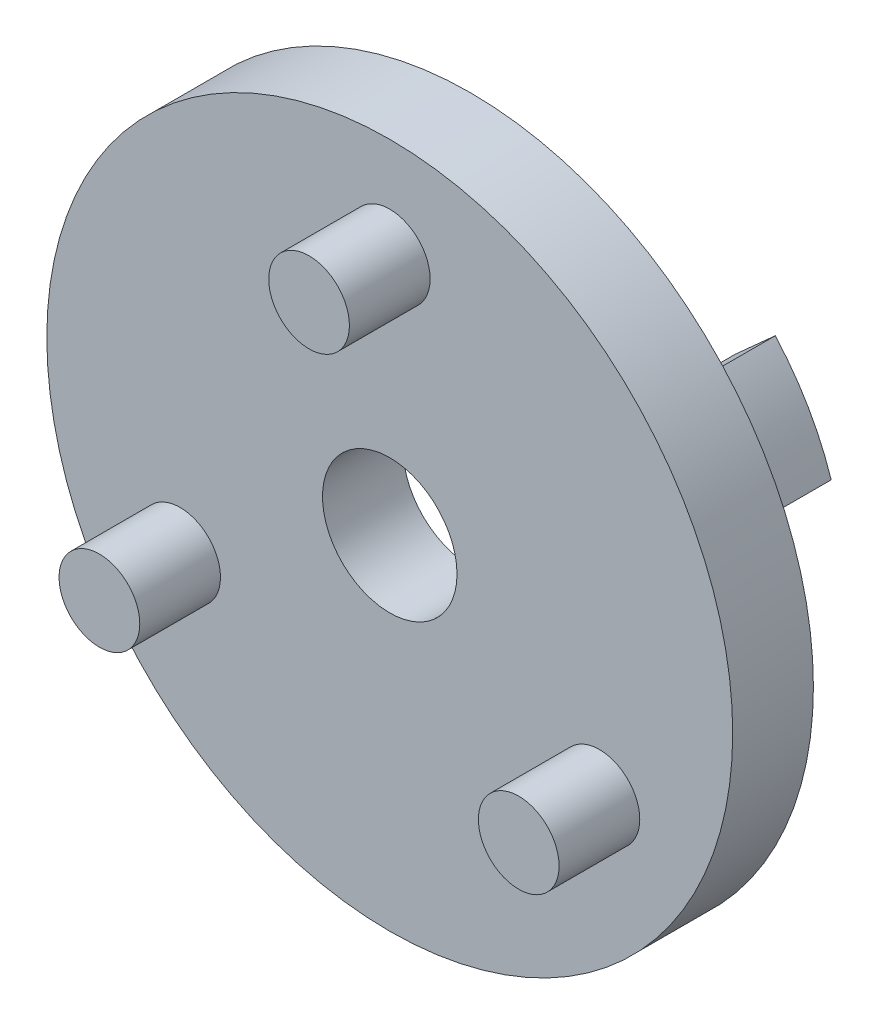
ISO-10303-21;
HEADER;
FILE_DESCRIPTION(('STEP AP214'),'2;1');
FILE_NAME('part.step','',(''),(''),'','','');
FILE_SCHEMA(('AUTOMOTIVE_DESIGN { 1 0 10303 214 1 1 1 1 }'));
ENDSEC;
DATA;
#1=APPLICATION_CONTEXT('core data for automotive mechanical design processes');
#2=APPLICATION_PROTOCOL_DEFINITION('international standard','automotive_design',2000,#1);
#3=PRODUCT_CONTEXT('',#1,'mechanical');
#4=PRODUCT('Part','Part','',(#3));
#5=PRODUCT_RELATED_PRODUCT_CATEGORY('part','',(#4));
#6=PRODUCT_DEFINITION_FORMATION('','',#4);
#7=PRODUCT_DEFINITION_CONTEXT('part definition',#1,'design');
#8=PRODUCT_DEFINITION('design','',#6,#7);
#9=PRODUCT_DEFINITION_SHAPE('','',#8);
#10=(LENGTH_UNIT() NAMED_UNIT(*) SI_UNIT(.MILLI.,.METRE.));
#11=(NAMED_UNIT(*) PLANE_ANGLE_UNIT() SI_UNIT($,.RADIAN.));
#12=(NAMED_UNIT(*) SI_UNIT($,.STERADIAN.) SOLID_ANGLE_UNIT());
#13=UNCERTAINTY_MEASURE_WITH_UNIT(LENGTH_MEASURE(1.E-05),#10,'distance_accuracy_value','');
#14=(GEOMETRIC_REPRESENTATION_CONTEXT(3) GLOBAL_UNCERTAINTY_ASSIGNED_CONTEXT((#13)) GLOBAL_UNIT_ASSIGNED_CONTEXT((#10,
#11,#12)) REPRESENTATION_CONTEXT('',''));
#15=CARTESIAN_POINT('',(0.,0.,0.));
#16=DIRECTION('',(0.,0.,1.));
#17=DIRECTION('',(1.,0.,0.));
#18=AXIS2_PLACEMENT_3D('',#15,#16,#17);
#19=CARTESIAN_POINT('',(0.,0.,0.));
#20=DIRECTION('',(0.,0.,1.));
#21=DIRECTION('',(1.,0.,0.));
#22=AXIS2_PLACEMENT_3D('',#19,#20,#21);
#23=PLANE('',#22);
#24=CARTESIAN_POINT('',(0.0188050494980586,0.00503879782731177,0.));
#25=DIRECTION('',(0.,0.,1.));
#26=DIRECTION('',(-1.,0.,0.));
#27=AXIS2_PLACEMENT_3D('',#24,#25,#26);
#28=CIRCLE('',#27,7.99999999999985);
#29=CARTESIAN_POINT('',(-5.92635355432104,5.35808364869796,0.));
#30=VERTEX_POINT('',#29);
#31=CARTESIAN_POINT('',(-7.58964708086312,2.47717475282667,0.));
#32=VERTEX_POINT('',#31);
#33=EDGE_CURVE('E147',#30,#32,#28,.T.);
#34=ORIENTED_EDGE('',*,*,#33,.F.);
#35=DIRECTION('',(0.743144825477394,-0.669130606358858,0.));
#36=VECTOR('',#35,1.);
#37=CARTESIAN_POINT('',(-5.92635355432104,5.35808364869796,0.));
#38=LINE('',#37,#36);
#39=CARTESIAN_POINT('',(-7.41264320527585,6.6963448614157,0.));
#40=VERTEX_POINT('',#39);
#41=EDGE_CURVE('E156',#40,#30,#38,.T.);
#42=ORIENTED_EDGE('',*,*,#41,.F.);
#43=CARTESIAN_POINT('',(0.0188050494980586,0.00503879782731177,0.));
#44=DIRECTION('',(0.,0.,-1.));
#45=DIRECTION('',(-1.,0.,0.));
#46=AXIS2_PLACEMENT_3D('',#43,#44,#45);
#47=CIRCLE('',#46,9.99999999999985);
#48=CARTESIAN_POINT('',(-9.49176011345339,3.09520874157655,0.));
#49=VERTEX_POINT('',#48);
#50=EDGE_CURVE('E153',#49,#40,#47,.T.);
#51=ORIENTED_EDGE('',*,*,#50,.F.);
#52=DIRECTION('',(-0.951056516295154,0.309016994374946,0.));
#53=VECTOR('',#52,1.);
#54=CARTESIAN_POINT('',(-7.58964708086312,2.47717475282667,0.));
#55=LINE('',#54,#53);
#56=EDGE_CURVE('E150',#32,#49,#55,.T.);
#57=ORIENTED_EDGE('',*,*,#56,.F.);
#58=EDGE_LOOP('',(#34,#42,#51,#57));
#59=FACE_BOUND('',#58,.T.);
#60=CARTESIAN_POINT('',(0.,0.,0.));
#61=DIRECTION('',(0.,0.,1.));
#62=DIRECTION('',(1.,0.,0.));
#63=AXIS2_PLACEMENT_3D('',#60,#61,#62);
#64=CIRCLE('',#63,2.5);
#65=CARTESIAN_POINT('',(2.5,0.,0.));
#66=VERTEX_POINT('',#65);
#67=EDGE_CURVE('E231',#66,#66,#64,.T.);
#68=ORIENTED_EDGE('',*,*,#67,.T.);
#69=EDGE_LOOP('',(#68));
#70=FACE_BOUND('',#69,.T.);
#71=CARTESIAN_POINT('',(0.,0.,0.));
#72=DIRECTION('',(0.,0.,1.));
#73=DIRECTION('',(1.,0.,0.));
#74=AXIS2_PLACEMENT_3D('',#71,#72,#73);
#75=CIRCLE('',#74,12.75);
#76=CARTESIAN_POINT('',(12.75,0.,0.));
#77=VERTEX_POINT('',#76);
#78=EDGE_CURVE('E38',#77,#77,#75,.T.);
#79=ORIENTED_EDGE('',*,*,#78,.F.);
#80=EDGE_LOOP('',(#79));
#81=FACE_BOUND('',#80,.T.);
#82=CARTESIAN_POINT('',(0.,0.,0.));
#83=DIRECTION('',(0.,0.,1.));
#84=DIRECTION('',(-1.,0.,0.));
#85=AXIS2_PLACEMENT_3D('',#82,#83,#84);
#86=CIRCLE('',#85,8.);
#87=CARTESIAN_POINT('',(7.60845213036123,2.47213595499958,0.));
#88=VERTEX_POINT('',#87);
#89=CARTESIAN_POINT('',(5.94515860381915,5.35304485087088,0.));
#90=VERTEX_POINT('',#89);
#91=EDGE_CURVE('E180',#88,#90,#86,.T.);
#92=ORIENTED_EDGE('',*,*,#91,.F.);
#93=DIRECTION('',(-0.951056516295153,-0.309016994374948,0.));
#94=VECTOR('',#93,1.);
#95=CARTESIAN_POINT('',(7.60845213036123,2.47213595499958,0.));
#96=LINE('',#95,#94);
#97=CARTESIAN_POINT('',(9.51056516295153,3.09016994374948,0.));
#98=VERTEX_POINT('',#97);
#99=EDGE_CURVE('E189',#98,#88,#96,.T.);
#100=ORIENTED_EDGE('',*,*,#99,.F.);
#101=CARTESIAN_POINT('',(0.,0.,0.));
#102=DIRECTION('',(0.,0.,-1.));
#103=DIRECTION('',(-1.,0.,0.));
#104=AXIS2_PLACEMENT_3D('',#101,#102,#103);
#105=CIRCLE('',#104,10.);
#106=CARTESIAN_POINT('',(7.43144825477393,6.69130606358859,0.));
#107=VERTEX_POINT('',#106);
#108=EDGE_CURVE('E186',#107,#98,#105,.T.);
#109=ORIENTED_EDGE('',*,*,#108,.F.);
#110=DIRECTION('',(0.743144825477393,0.669130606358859,0.));
#111=VECTOR('',#110,1.);
#112=CARTESIAN_POINT('',(5.94515860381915,5.35304485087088,0.));
#113=LINE('',#112,#111);
#114=EDGE_CURVE('E183',#90,#107,#113,.T.);
#115=ORIENTED_EDGE('',*,*,#114,.F.);
#116=EDGE_LOOP('',(#92,#100,#109,#115));
#117=FACE_BOUND('',#116,.T.);
#118=CARTESIAN_POINT('',(0.00503879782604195,0.0188050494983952,0.));
#119=DIRECTION('',(0.,0.,1.));
#120=DIRECTION('',(-1.,0.,0.));
#121=AXIS2_PLACEMENT_3D('',#118,#119,#120);
#122=CIRCLE('',#121,8.00000000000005);
#123=CARTESIAN_POINT('',(-1.65825472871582,-7.8063757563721,0.));
#124=VERTEX_POINT('',#123);
#125=CARTESIAN_POINT('',(1.66833232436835,-7.8063757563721,0.));
#126=VERTEX_POINT('',#125);
#127=EDGE_CURVE('E115',#124,#126,#122,.T.);
#128=ORIENTED_EDGE('',*,*,#127,.F.);
#129=DIRECTION('',(0.207911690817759,0.978147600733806,0.));
#130=VECTOR('',#129,1.);
#131=CARTESIAN_POINT('',(-1.65825472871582,-7.8063757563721,0.));
#132=LINE('',#131,#130);
#133=CARTESIAN_POINT('',(-2.07407811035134,-9.76267095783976,0.));
#134=VERTEX_POINT('',#133);
#135=EDGE_CURVE('E117',#134,#124,#132,.T.);
#136=ORIENTED_EDGE('',*,*,#135,.F.);
#137=CARTESIAN_POINT('',(0.00503879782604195,0.0188050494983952,0.));
#138=DIRECTION('',(0.,0.,-1.));
#139=DIRECTION('',(-1.,0.,0.));
#140=AXIS2_PLACEMENT_3D('',#137,#138,#139);
#141=CIRCLE('',#140,10.0000000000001);
#142=CARTESIAN_POINT('',(2.08415570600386,-9.76267095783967,0.));
#143=VERTEX_POINT('',#142);
#144=EDGE_CURVE('E50',#143,#134,#141,.T.);
#145=ORIENTED_EDGE('',*,*,#144,.F.);
#146=DIRECTION('',(0.207911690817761,-0.978147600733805,0.));
#147=VECTOR('',#146,1.);
#148=CARTESIAN_POINT('',(1.66833232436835,-7.8063757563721,0.));
#149=LINE('',#148,#147);
#150=EDGE_CURVE('E45',#126,#143,#149,.T.);
#151=ORIENTED_EDGE('',*,*,#150,.F.);
#152=EDGE_LOOP('',(#128,#136,#145,#151));
#153=FACE_BOUND('',#152,.T.);
#154=ADVANCED_FACE('F30',(#59,#70,#81,#117,#153),#23,.F.);
#155=CARTESIAN_POINT('',(0.,0.,3.));
#156=DIRECTION('',(0.,0.,1.));
#157=DIRECTION('',(1.,0.,0.));
#158=AXIS2_PLACEMENT_3D('',#155,#156,#157);
#159=PLANE('',#158);
#160=CARTESIAN_POINT('',(7.79422863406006,-4.49999999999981,3.));
#161=DIRECTION('',(0.,0.,1.));
#162=DIRECTION('',(1.,0.,0.));
#163=AXIS2_PLACEMENT_3D('',#160,#161,#162);
#164=CIRCLE('',#163,1.50000000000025);
#165=CARTESIAN_POINT('',(9.29422863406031,-4.49999999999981,3.));
#166=VERTEX_POINT('',#165);
#167=EDGE_CURVE('E219',#166,#166,#164,.T.);
#168=ORIENTED_EDGE('',*,*,#167,.F.);
#169=EDGE_LOOP('',(#168));
#170=FACE_BOUND('',#169,.T.);
#171=CARTESIAN_POINT('',(0.,0.,3.));
#172=DIRECTION('',(0.,0.,1.));
#173=DIRECTION('',(1.,0.,0.));
#174=AXIS2_PLACEMENT_3D('',#171,#172,#173);
#175=CIRCLE('',#174,2.5);
#176=CARTESIAN_POINT('',(2.5,0.,3.));
#177=VERTEX_POINT('',#176);
#178=EDGE_CURVE('E234',#177,#177,#175,.T.);
#179=ORIENTED_EDGE('',*,*,#178,.F.);
#180=EDGE_LOOP('',(#179));
#181=FACE_BOUND('',#180,.T.);
#182=CARTESIAN_POINT('',(0.,0.,3.));
#183=DIRECTION('',(0.,0.,1.));
#184=DIRECTION('',(1.,0.,0.));
#185=AXIS2_PLACEMENT_3D('',#182,#183,#184);
#186=CIRCLE('',#185,12.75);
#187=CARTESIAN_POINT('',(12.75,0.,3.));
#188=VERTEX_POINT('',#187);
#189=EDGE_CURVE('E11',#188,#188,#186,.T.);
#190=ORIENTED_EDGE('',*,*,#189,.T.);
#191=EDGE_LOOP('',(#190));
#192=FACE_BOUND('',#191,.T.);
#193=CARTESIAN_POINT('',(0.,9.,3.));
#194=DIRECTION('',(0.,0.,1.));
#195=DIRECTION('',(1.,0.,0.));
#196=AXIS2_PLACEMENT_3D('',#193,#194,#195);
#197=CIRCLE('',#196,1.5);
#198=CARTESIAN_POINT('',(1.5,9.,3.));
#199=VERTEX_POINT('',#198);
#200=EDGE_CURVE('E225',#199,#199,#197,.T.);
#201=ORIENTED_EDGE('',*,*,#200,.F.);
#202=EDGE_LOOP('',(#201));
#203=FACE_BOUND('',#202,.T.);
#204=CARTESIAN_POINT('',(-7.79422863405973,-4.5,3.));
#205=DIRECTION('',(0.,0.,1.));
#206=DIRECTION('',(1.,0.,0.));
#207=AXIS2_PLACEMENT_3D('',#204,#205,#206);
#208=CIRCLE('',#207,1.50000000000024);
#209=CARTESIAN_POINT('',(-6.29422863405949,-4.5,3.));
#210=VERTEX_POINT('',#209);
#211=EDGE_CURVE('E213',#210,#210,#208,.T.);
#212=ORIENTED_EDGE('',*,*,#211,.F.);
#213=EDGE_LOOP('',(#212));
#214=FACE_BOUND('',#213,.T.);
#215=ADVANCED_FACE('F242',(#170,#181,#192,#203,#214),#159,.T.);
#216=CARTESIAN_POINT('',(0.,0.,3.));
#217=DIRECTION('',(0.,0.,-1.));
#218=DIRECTION('',(-1.,0.,0.));
#219=AXIS2_PLACEMENT_3D('',#216,#217,#218);
#220=CYLINDRICAL_SURFACE('',#219,12.75);
#221=ORIENTED_EDGE('',*,*,#189,.F.);
#222=EDGE_LOOP('',(#221));
#223=FACE_BOUND('',#222,.T.);
#224=ORIENTED_EDGE('',*,*,#78,.T.);
#225=EDGE_LOOP('',(#224));
#226=FACE_BOUND('',#225,.T.);
#227=ADVANCED_FACE('F32',(#223,#226),#220,.T.);
#228=CARTESIAN_POINT('',(0.,0.,3.));
#229=DIRECTION('',(0.,0.,-1.));
#230=DIRECTION('',(-1.,0.,0.));
#231=AXIS2_PLACEMENT_3D('',#228,#229,#230);
#232=CYLINDRICAL_SURFACE('',#231,2.5);
#233=ORIENTED_EDGE('',*,*,#178,.T.);
#234=EDGE_LOOP('',(#233));
#235=FACE_BOUND('',#234,.T.);
#236=ORIENTED_EDGE('',*,*,#67,.F.);
#237=EDGE_LOOP('',(#236));
#238=FACE_BOUND('',#237,.T.);
#239=ADVANCED_FACE('F295',(#235,#238),#232,.F.);
#240=CARTESIAN_POINT('',(0.,9.,6.));
#241=DIRECTION('',(0.,0.,-1.));
#242=DIRECTION('',(-1.,0.,0.));
#243=AXIS2_PLACEMENT_3D('',#240,#241,#242);
#244=CYLINDRICAL_SURFACE('',#243,1.5);
#245=CARTESIAN_POINT('',(0.,9.,6.));
#246=DIRECTION('',(0.,0.,1.));
#247=DIRECTION('',(1.,0.,0.));
#248=AXIS2_PLACEMENT_3D('',#245,#246,#247);
#249=CIRCLE('',#248,1.5);
#250=CARTESIAN_POINT('',(1.5,9.,6.));
#251=VERTEX_POINT('',#250);
#252=EDGE_CURVE('E228',#251,#251,#249,.T.);
#253=ORIENTED_EDGE('',*,*,#252,.F.);
#254=EDGE_LOOP('',(#253));
#255=FACE_BOUND('',#254,.T.);
#256=ORIENTED_EDGE('',*,*,#200,.T.);
#257=EDGE_LOOP('',(#256));
#258=FACE_BOUND('',#257,.T.);
#259=ADVANCED_FACE('F291',(#255,#258),#244,.T.);
#260=CARTESIAN_POINT('',(0.,9.,6.));
#261=DIRECTION('',(0.,0.,1.));
#262=DIRECTION('',(1.,0.,0.));
#263=AXIS2_PLACEMENT_3D('',#260,#261,#262);
#264=PLANE('',#263);
#265=ORIENTED_EDGE('',*,*,#252,.T.);
#266=EDGE_LOOP('',(#265));
#267=FACE_BOUND('',#266,.T.);
#268=ADVANCED_FACE('F287',(#267),#264,.T.);
#269=CARTESIAN_POINT('',(7.79422863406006,-4.49999999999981,6.));
#270=DIRECTION('',(0.,0.,-1.));
#271=DIRECTION('',(-1.,0.,0.));
#272=AXIS2_PLACEMENT_3D('',#269,#270,#271);
#273=CYLINDRICAL_SURFACE('',#272,1.50000000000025);
#274=CARTESIAN_POINT('',(7.79422863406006,-4.49999999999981,6.));
#275=DIRECTION('',(0.,0.,1.));
#276=DIRECTION('',(1.,0.,0.));
#277=AXIS2_PLACEMENT_3D('',#274,#275,#276);
#278=CIRCLE('',#277,1.50000000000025);
#279=CARTESIAN_POINT('',(9.29422863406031,-4.49999999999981,6.));
#280=VERTEX_POINT('',#279);
#281=EDGE_CURVE('E222',#280,#280,#278,.T.);
#282=ORIENTED_EDGE('',*,*,#281,.F.);
#283=EDGE_LOOP('',(#282));
#284=FACE_BOUND('',#283,.T.);
#285=ORIENTED_EDGE('',*,*,#167,.T.);
#286=EDGE_LOOP('',(#285));
#287=FACE_BOUND('',#286,.T.);
#288=ADVANCED_FACE('F283',(#284,#287),#273,.T.);
#289=CARTESIAN_POINT('',(7.79422863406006,-4.49999999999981,6.));
#290=DIRECTION('',(0.,0.,1.));
#291=DIRECTION('',(1.,0.,0.));
#292=AXIS2_PLACEMENT_3D('',#289,#290,#291);
#293=PLANE('',#292);
#294=ORIENTED_EDGE('',*,*,#281,.T.);
#295=EDGE_LOOP('',(#294));
#296=FACE_BOUND('',#295,.T.);
#297=ADVANCED_FACE('F279',(#296),#293,.T.);
#298=CARTESIAN_POINT('',(-7.79422863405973,-4.5,6.));
#299=DIRECTION('',(0.,0.,-1.));
#300=DIRECTION('',(-1.,0.,0.));
#301=AXIS2_PLACEMENT_3D('',#298,#299,#300);
#302=CYLINDRICAL_SURFACE('',#301,1.50000000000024);
#303=CARTESIAN_POINT('',(-7.79422863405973,-4.5,6.));
#304=DIRECTION('',(0.,0.,1.));
#305=DIRECTION('',(1.,0.,0.));
#306=AXIS2_PLACEMENT_3D('',#303,#304,#305);
#307=CIRCLE('',#306,1.50000000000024);
#308=CARTESIAN_POINT('',(-6.29422863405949,-4.5,6.));
#309=VERTEX_POINT('',#308);
#310=EDGE_CURVE('E216',#309,#309,#307,.T.);
#311=ORIENTED_EDGE('',*,*,#310,.F.);
#312=EDGE_LOOP('',(#311));
#313=FACE_BOUND('',#312,.T.);
#314=ORIENTED_EDGE('',*,*,#211,.T.);
#315=EDGE_LOOP('',(#314));
#316=FACE_BOUND('',#315,.T.);
#317=ADVANCED_FACE('F275',(#313,#316),#302,.T.);
#318=CARTESIAN_POINT('',(-7.79422863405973,-4.5,6.));
#319=DIRECTION('',(0.,0.,1.));
#320=DIRECTION('',(1.,0.,0.));
#321=AXIS2_PLACEMENT_3D('',#318,#319,#320);
#322=PLANE('',#321);
#323=ORIENTED_EDGE('',*,*,#310,.T.);
#324=EDGE_LOOP('',(#323));
#325=FACE_BOUND('',#324,.T.);
#326=ADVANCED_FACE('F269',(#325),#322,.T.);
#327=CARTESIAN_POINT('',(0.,0.,-3.9));
#328=DIRECTION('',(0.,0.,1.));
#329=DIRECTION('',(1.,0.,0.));
#330=AXIS2_PLACEMENT_3D('',#327,#328,#329);
#331=CYLINDRICAL_SURFACE('',#330,8.);
#332=ORIENTED_EDGE('',*,*,#91,.T.);
#333=DIRECTION('',(0.,0.,1.));
#334=VECTOR('',#333,1.);
#335=CARTESIAN_POINT('',(5.94515860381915,5.35304485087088,-3.9));
#336=LINE('',#335,#334);
#337=CARTESIAN_POINT('',(5.94515860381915,5.35304485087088,-3.9));
#338=VERTEX_POINT('',#337);
#339=EDGE_CURVE('E210',#338,#90,#336,.T.);
#340=ORIENTED_EDGE('',*,*,#339,.F.);
#341=CARTESIAN_POINT('',(0.,0.,-3.9));
#342=DIRECTION('',(0.,0.,1.));
#343=DIRECTION('',(-1.,0.,0.));
#344=AXIS2_PLACEMENT_3D('',#341,#342,#343);
#345=CIRCLE('',#344,8.);
#346=CARTESIAN_POINT('',(7.60845213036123,2.47213595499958,-3.9));
#347=VERTEX_POINT('',#346);
#348=EDGE_CURVE('E192',#347,#338,#345,.T.);
#349=ORIENTED_EDGE('',*,*,#348,.F.);
#350=DIRECTION('',(0.,0.,1.));
#351=VECTOR('',#350,1.);
#352=CARTESIAN_POINT('',(7.60845213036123,2.47213595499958,-3.9));
#353=LINE('',#352,#351);
#354=EDGE_CURVE('E201',#347,#88,#353,.T.);
#355=ORIENTED_EDGE('',*,*,#354,.T.);
#356=EDGE_LOOP('',(#332,#340,#349,#355));
#357=FACE_BOUND('',#356,.T.);
#358=ADVANCED_FACE('F253',(#357),#331,.F.);
#359=CARTESIAN_POINT('',(5.94515860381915,5.35304485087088,-3.9));
#360=DIRECTION('',(0.669130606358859,-0.743144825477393,0.));
#361=DIRECTION('',(0.743144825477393,0.669130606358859,0.));
#362=AXIS2_PLACEMENT_3D('',#359,#360,#361);
#363=PLANE('',#362);
#364=ORIENTED_EDGE('',*,*,#114,.T.);
#365=DIRECTION('',(0.,0.,1.));
#366=VECTOR('',#365,1.);
#367=CARTESIAN_POINT('',(7.43144825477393,6.69130606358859,-3.9));
#368=LINE('',#367,#366);
#369=CARTESIAN_POINT('',(7.43144825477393,6.69130606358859,-3.9));
#370=VERTEX_POINT('',#369);
#371=EDGE_CURVE('E207',#370,#107,#368,.T.);
#372=ORIENTED_EDGE('',*,*,#371,.F.);
#373=DIRECTION('',(0.743144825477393,0.669130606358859,0.));
#374=VECTOR('',#373,1.);
#375=CARTESIAN_POINT('',(5.94515860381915,5.35304485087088,-3.9));
#376=LINE('',#375,#374);
#377=EDGE_CURVE('E195',#338,#370,#376,.T.);
#378=ORIENTED_EDGE('',*,*,#377,.F.);
#379=ORIENTED_EDGE('',*,*,#339,.T.);
#380=EDGE_LOOP('',(#364,#372,#378,#379));
#381=FACE_BOUND('',#380,.T.);
#382=ADVANCED_FACE('F261',(#381),#363,.F.);
#383=CARTESIAN_POINT('',(0.,0.,-3.9));
#384=DIRECTION('',(0.,0.,1.));
#385=DIRECTION('',(1.,0.,0.));
#386=AXIS2_PLACEMENT_3D('',#383,#384,#385);
#387=CYLINDRICAL_SURFACE('',#386,10.);
#388=ORIENTED_EDGE('',*,*,#108,.T.);
#389=DIRECTION('',(0.,0.,1.));
#390=VECTOR('',#389,1.);
#391=CARTESIAN_POINT('',(9.51056516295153,3.09016994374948,-3.9));
#392=LINE('',#391,#390);
#393=CARTESIAN_POINT('',(9.51056516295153,3.09016994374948,-3.9));
#394=VERTEX_POINT('',#393);
#395=EDGE_CURVE('E204',#394,#98,#392,.T.);
#396=ORIENTED_EDGE('',*,*,#395,.F.);
#397=CARTESIAN_POINT('',(0.,0.,-3.9));
#398=DIRECTION('',(0.,0.,-1.));
#399=DIRECTION('',(-1.,0.,0.));
#400=AXIS2_PLACEMENT_3D('',#397,#398,#399);
#401=CIRCLE('',#400,10.);
#402=EDGE_CURVE('E197',#370,#394,#401,.T.);
#403=ORIENTED_EDGE('',*,*,#402,.F.);
#404=ORIENTED_EDGE('',*,*,#371,.T.);
#405=EDGE_LOOP('',(#388,#396,#403,#404));
#406=FACE_BOUND('',#405,.T.);
#407=ADVANCED_FACE('F259',(#406),#387,.T.);
#408=CARTESIAN_POINT('',(7.60845213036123,2.47213595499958,-3.9));
#409=DIRECTION('',(-0.309016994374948,0.951056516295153,0.));
#410=DIRECTION('',(-0.951056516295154,-0.309016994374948,0.));
#411=AXIS2_PLACEMENT_3D('',#408,#409,#410);
#412=PLANE('',#411);
#413=ORIENTED_EDGE('',*,*,#99,.T.);
#414=ORIENTED_EDGE('',*,*,#354,.F.);
#415=DIRECTION('',(-0.951056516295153,-0.309016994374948,0.));
#416=VECTOR('',#415,1.);
#417=CARTESIAN_POINT('',(7.60845213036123,2.47213595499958,-3.9));
#418=LINE('',#417,#416);
#419=EDGE_CURVE('E199',#394,#347,#418,.T.);
#420=ORIENTED_EDGE('',*,*,#419,.F.);
#421=ORIENTED_EDGE('',*,*,#395,.T.);
#422=EDGE_LOOP('',(#413,#414,#420,#421));
#423=FACE_BOUND('',#422,.T.);
#424=ADVANCED_FACE('F249',(#423),#412,.F.);
#425=CARTESIAN_POINT('',(0.,0.,-3.9));
#426=DIRECTION('',(0.,0.,-1.));
#427=DIRECTION('',(-1.,0.,0.));
#428=AXIS2_PLACEMENT_3D('',#425,#426,#427);
#429=PLANE('',#428);
#430=ORIENTED_EDGE('',*,*,#348,.T.);
#431=ORIENTED_EDGE('',*,*,#377,.T.);
#432=ORIENTED_EDGE('',*,*,#402,.T.);
#433=ORIENTED_EDGE('',*,*,#419,.T.);
#434=EDGE_LOOP('',(#430,#431,#432,#433));
#435=FACE_BOUND('',#434,.T.);
#436=ADVANCED_FACE('F255',(#435),#429,.T.);
#437=CARTESIAN_POINT('',(0.0188050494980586,0.00503879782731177,-3.9));
#438=DIRECTION('',(0.,0.,1.));
#439=DIRECTION('',(1.,0.,0.));
#440=AXIS2_PLACEMENT_3D('',#437,#438,#439);
#441=CYLINDRICAL_SURFACE('',#440,7.99999999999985);
#442=ORIENTED_EDGE('',*,*,#33,.T.);
#443=DIRECTION('',(0.,0.,1.));
#444=VECTOR('',#443,1.);
#445=CARTESIAN_POINT('',(-7.58964708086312,2.47717475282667,-3.9));
#446=LINE('',#445,#444);
#447=CARTESIAN_POINT('',(-7.58964708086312,2.47717475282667,-3.9));
#448=VERTEX_POINT('',#447);
#449=EDGE_CURVE('E177',#448,#32,#446,.T.);
#450=ORIENTED_EDGE('',*,*,#449,.F.);
#451=CARTESIAN_POINT('',(0.0188050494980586,0.00503879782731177,-3.9));
#452=DIRECTION('',(0.,0.,1.));
#453=DIRECTION('',(-1.,0.,0.));
#454=AXIS2_PLACEMENT_3D('',#451,#452,#453);
#455=CIRCLE('',#454,7.99999999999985);
#456=CARTESIAN_POINT('',(-5.92635355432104,5.35808364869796,-3.9));
#457=VERTEX_POINT('',#456);
#458=EDGE_CURVE('E159',#457,#448,#455,.T.);
#459=ORIENTED_EDGE('',*,*,#458,.F.);
#460=DIRECTION('',(0.,0.,1.));
#461=VECTOR('',#460,1.);
#462=CARTESIAN_POINT('',(-5.92635355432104,5.35808364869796,-3.9));
#463=LINE('',#462,#461);
#464=EDGE_CURVE('E168',#457,#30,#463,.T.);
#465=ORIENTED_EDGE('',*,*,#464,.T.);
#466=EDGE_LOOP('',(#442,#450,#459,#465));
#467=FACE_BOUND('',#466,.T.);
#468=ADVANCED_FACE('F383',(#467),#441,.F.);
#469=CARTESIAN_POINT('',(-7.58964708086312,2.47717475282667,-3.9));
#470=DIRECTION('',(0.309016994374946,0.951056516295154,0.));
#471=DIRECTION('',(-0.951056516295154,0.309016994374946,0.));
#472=AXIS2_PLACEMENT_3D('',#469,#470,#471);
#473=PLANE('',#472);
#474=ORIENTED_EDGE('',*,*,#56,.T.);
#475=DIRECTION('',(0.,0.,1.));
#476=VECTOR('',#475,1.);
#477=CARTESIAN_POINT('',(-9.49176011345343,3.09520874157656,-3.9));
#478=LINE('',#477,#476);
#479=CARTESIAN_POINT('',(-9.49176011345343,3.09520874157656,-3.9));
#480=VERTEX_POINT('',#479);
#481=EDGE_CURVE('E174',#480,#49,#478,.T.);
#482=ORIENTED_EDGE('',*,*,#481,.F.);
#483=DIRECTION('',(-0.951056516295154,0.309016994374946,0.));
#484=VECTOR('',#483,1.);
#485=CARTESIAN_POINT('',(-7.58964708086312,2.47717475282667,-3.9));
#486=LINE('',#485,#484);
#487=EDGE_CURVE('E162',#448,#480,#486,.T.);
#488=ORIENTED_EDGE('',*,*,#487,.F.);
#489=ORIENTED_EDGE('',*,*,#449,.T.);
#490=EDGE_LOOP('',(#474,#482,#488,#489));
#491=FACE_BOUND('',#490,.T.);
#492=ADVANCED_FACE('F392',(#491),#473,.F.);
#493=CARTESIAN_POINT('',(0.0188050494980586,0.00503879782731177,-3.9));
#494=DIRECTION('',(0.,0.,1.));
#495=DIRECTION('',(1.,0.,0.));
#496=AXIS2_PLACEMENT_3D('',#493,#494,#495);
#497=CYLINDRICAL_SURFACE('',#496,9.99999999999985);
#498=ORIENTED_EDGE('',*,*,#50,.T.);
#499=DIRECTION('',(0.,0.,1.));
#500=VECTOR('',#499,1.);
#501=CARTESIAN_POINT('',(-7.41264320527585,6.6963448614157,-3.9));
#502=LINE('',#501,#500);
#503=CARTESIAN_POINT('',(-7.41264320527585,6.6963448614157,-3.9));
#504=VERTEX_POINT('',#503);
#505=EDGE_CURVE('E171',#504,#40,#502,.T.);
#506=ORIENTED_EDGE('',*,*,#505,.F.);
#507=CARTESIAN_POINT('',(0.0188050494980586,0.00503879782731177,-3.9));
#508=DIRECTION('',(0.,0.,-1.));
#509=DIRECTION('',(-1.,0.,0.));
#510=AXIS2_PLACEMENT_3D('',#507,#508,#509);
#511=CIRCLE('',#510,9.99999999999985);
#512=EDGE_CURVE('E164',#480,#504,#511,.T.);
#513=ORIENTED_EDGE('',*,*,#512,.F.);
#514=ORIENTED_EDGE('',*,*,#481,.T.);
#515=EDGE_LOOP('',(#498,#506,#513,#514));
#516=FACE_BOUND('',#515,.T.);
#517=ADVANCED_FACE('F402',(#516),#497,.T.);
#518=CARTESIAN_POINT('',(-5.92635355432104,5.35808364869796,-3.9));
#519=DIRECTION('',(-0.669130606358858,-0.743144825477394,0.));
#520=DIRECTION('',(0.743144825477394,-0.669130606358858,0.));
#521=AXIS2_PLACEMENT_3D('',#518,#519,#520);
#522=PLANE('',#521);
#523=ORIENTED_EDGE('',*,*,#41,.T.);
#524=ORIENTED_EDGE('',*,*,#464,.F.);
#525=DIRECTION('',(0.743144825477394,-0.669130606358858,0.));
#526=VECTOR('',#525,1.);
#527=CARTESIAN_POINT('',(-5.92635355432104,5.35808364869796,-3.9));
#528=LINE('',#527,#526);
#529=EDGE_CURVE('E166',#504,#457,#528,.T.);
#530=ORIENTED_EDGE('',*,*,#529,.F.);
#531=ORIENTED_EDGE('',*,*,#505,.T.);
#532=EDGE_LOOP('',(#523,#524,#530,#531));
#533=FACE_BOUND('',#532,.T.);
#534=ADVANCED_FACE('F412',(#533),#522,.F.);
#535=CARTESIAN_POINT('',(0.0188050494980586,0.00503879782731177,-3.9));
#536=DIRECTION('',(0.,0.,-1.));
#537=DIRECTION('',(-1.,0.,0.));
#538=AXIS2_PLACEMENT_3D('',#535,#536,#537);
#539=PLANE('',#538);
#540=ORIENTED_EDGE('',*,*,#458,.T.);
#541=ORIENTED_EDGE('',*,*,#487,.T.);
#542=ORIENTED_EDGE('',*,*,#512,.T.);
#543=ORIENTED_EDGE('',*,*,#529,.T.);
#544=EDGE_LOOP('',(#540,#541,#542,#543));
#545=FACE_BOUND('',#544,.T.);
#546=ADVANCED_FACE('F422',(#545),#539,.T.);
#547=CARTESIAN_POINT('',(0.00503879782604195,0.0188050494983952,-3.9));
#548=DIRECTION('',(0.,0.,1.));
#549=DIRECTION('',(1.,0.,0.));
#550=AXIS2_PLACEMENT_3D('',#547,#548,#549);
#551=CYLINDRICAL_SURFACE('',#550,8.00000000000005);
#552=ORIENTED_EDGE('',*,*,#127,.T.);
#553=DIRECTION('',(0.,0.,1.));
#554=VECTOR('',#553,1.);
#555=CARTESIAN_POINT('',(1.66833232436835,-7.8063757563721,-3.9));
#556=LINE('',#555,#554);
#557=CARTESIAN_POINT('',(1.66833232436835,-7.8063757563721,-3.9));
#558=VERTEX_POINT('',#557);
#559=EDGE_CURVE('E145',#558,#126,#556,.T.);
#560=ORIENTED_EDGE('',*,*,#559,.F.);
#561=CARTESIAN_POINT('',(0.00503879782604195,0.0188050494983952,-3.9));
#562=DIRECTION('',(0.,0.,1.));
#563=DIRECTION('',(-1.,0.,0.));
#564=AXIS2_PLACEMENT_3D('',#561,#562,#563);
#565=CIRCLE('',#564,8.00000000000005);
#566=CARTESIAN_POINT('',(-1.65825472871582,-7.8063757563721,-3.9));
#567=VERTEX_POINT('',#566);
#568=EDGE_CURVE('E131',#567,#558,#565,.T.);
#569=ORIENTED_EDGE('',*,*,#568,.F.);
#570=DIRECTION('',(0.,0.,1.));
#571=VECTOR('',#570,1.);
#572=CARTESIAN_POINT('',(-1.65825472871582,-7.8063757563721,-3.9));
#573=LINE('',#572,#571);
#574=EDGE_CURVE('E127',#567,#124,#573,.T.);
#575=ORIENTED_EDGE('',*,*,#574,.T.);
#576=EDGE_LOOP('',(#552,#560,#569,#575));
#577=FACE_BOUND('',#576,.T.);
#578=ADVANCED_FACE('F133',(#577),#551,.F.);
#579=CARTESIAN_POINT('',(1.66833232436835,-7.8063757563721,-3.9));
#580=DIRECTION('',(-0.978147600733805,-0.207911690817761,0.));
#581=DIRECTION('',(0.207911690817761,-0.978147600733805,0.));
#582=AXIS2_PLACEMENT_3D('',#579,#580,#581);
#583=PLANE('',#582);
#584=ORIENTED_EDGE('',*,*,#150,.T.);
#585=DIRECTION('',(0.,0.,1.));
#586=VECTOR('',#585,1.);
#587=CARTESIAN_POINT('',(2.08415570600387,-9.76267095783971,-3.9));
#588=LINE('',#587,#586);
#589=CARTESIAN_POINT('',(2.08415570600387,-9.76267095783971,-3.9));
#590=VERTEX_POINT('',#589);
#591=EDGE_CURVE('E137',#590,#143,#588,.T.);
#592=ORIENTED_EDGE('',*,*,#591,.F.);
#593=DIRECTION('',(0.207911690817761,-0.978147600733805,0.));
#594=VECTOR('',#593,1.);
#595=CARTESIAN_POINT('',(1.66833232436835,-7.8063757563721,-3.9));
#596=LINE('',#595,#594);
#597=EDGE_CURVE('E482',#558,#590,#596,.T.);
#598=ORIENTED_EDGE('',*,*,#597,.F.);
#599=ORIENTED_EDGE('',*,*,#559,.T.);
#600=EDGE_LOOP('',(#584,#592,#598,#599));
#601=FACE_BOUND('',#600,.T.);
#602=ADVANCED_FACE('F441',(#601),#583,.F.);
#603=CARTESIAN_POINT('',(0.00503879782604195,0.0188050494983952,-3.9));
#604=DIRECTION('',(0.,0.,1.));
#605=DIRECTION('',(1.,0.,0.));
#606=AXIS2_PLACEMENT_3D('',#603,#604,#605);
#607=CYLINDRICAL_SURFACE('',#606,10.0000000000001);
#608=ORIENTED_EDGE('',*,*,#144,.T.);
#609=DIRECTION('',(0.,0.,1.));
#610=VECTOR('',#609,1.);
#611=CARTESIAN_POINT('',(-2.07407811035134,-9.76267095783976,-3.9));
#612=LINE('',#611,#610);
#613=CARTESIAN_POINT('',(-2.07407811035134,-9.76267095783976,-3.9));
#614=VERTEX_POINT('',#613);
#615=EDGE_CURVE('E130',#614,#134,#612,.T.);
#616=ORIENTED_EDGE('',*,*,#615,.F.);
#617=CARTESIAN_POINT('',(0.00503879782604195,0.0188050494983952,-3.9));
#618=DIRECTION('',(0.,0.,-1.));
#619=DIRECTION('',(-1.,0.,0.));
#620=AXIS2_PLACEMENT_3D('',#617,#618,#619);
#621=CIRCLE('',#620,10.0000000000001);
#622=EDGE_CURVE('E139',#590,#614,#621,.T.);
#623=ORIENTED_EDGE('',*,*,#622,.F.);
#624=ORIENTED_EDGE('',*,*,#591,.T.);
#625=EDGE_LOOP('',(#608,#616,#623,#624));
#626=FACE_BOUND('',#625,.T.);
#627=ADVANCED_FACE('F450',(#626),#607,.T.);
#628=CARTESIAN_POINT('',(-1.65825472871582,-7.8063757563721,-3.9));
#629=DIRECTION('',(0.978147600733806,-0.207911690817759,0.));
#630=DIRECTION('',(0.207911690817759,0.978147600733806,0.));
#631=AXIS2_PLACEMENT_3D('',#628,#629,#630);
#632=PLANE('',#631);
#633=ORIENTED_EDGE('',*,*,#135,.T.);
#634=ORIENTED_EDGE('',*,*,#574,.F.);
#635=DIRECTION('',(0.207911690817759,0.978147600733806,0.));
#636=VECTOR('',#635,1.);
#637=CARTESIAN_POINT('',(-1.65825472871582,-7.8063757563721,-3.9));
#638=LINE('',#637,#636);
#639=EDGE_CURVE('E135',#614,#567,#638,.T.);
#640=ORIENTED_EDGE('',*,*,#639,.F.);
#641=ORIENTED_EDGE('',*,*,#615,.T.);
#642=EDGE_LOOP('',(#633,#634,#640,#641));
#643=FACE_BOUND('',#642,.T.);
#644=ADVANCED_FACE('F125',(#643),#632,.F.);
#645=CARTESIAN_POINT('',(0.00503879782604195,0.0188050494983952,-3.9));
#646=DIRECTION('',(0.,0.,-1.));
#647=DIRECTION('',(-1.,0.,0.));
#648=AXIS2_PLACEMENT_3D('',#645,#646,#647);
#649=PLANE('',#648);
#650=ORIENTED_EDGE('',*,*,#568,.T.);
#651=ORIENTED_EDGE('',*,*,#597,.T.);
#652=ORIENTED_EDGE('',*,*,#622,.T.);
#653=ORIENTED_EDGE('',*,*,#639,.T.);
#654=EDGE_LOOP('',(#650,#651,#652,#653));
#655=FACE_BOUND('',#654,.T.);
#656=ADVANCED_FACE('F469',(#655),#649,.T.);
#657=CLOSED_SHELL('',(#154,#215,#227,#239,#259,#268,#288,#297,#317,#326,#358,#382,#407,#424,
#436,#468,#492,#517,#534,#546,#578,#602,#627,#644,#656));
#658=MANIFOLD_SOLID_BREP('B2',#657);
#659=ADVANCED_BREP_SHAPE_REPRESENTATION('',(#18,#658),#14);
#660=SHAPE_DEFINITION_REPRESENTATION(#9,#659);
ENDSEC;
END-ISO-10303-21;
